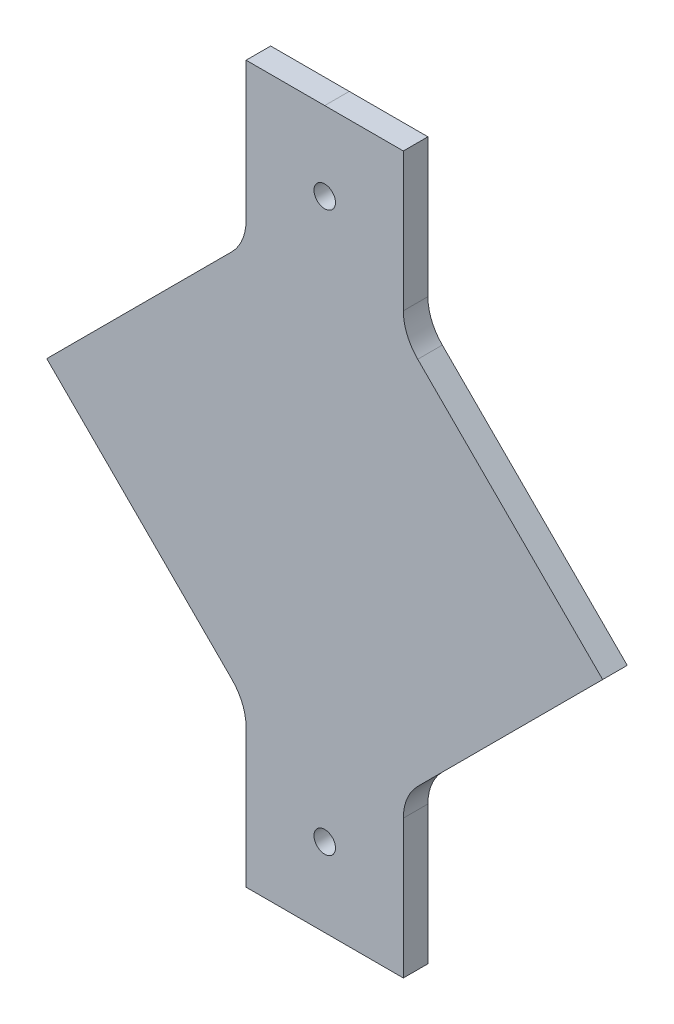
from build123d import *

# Parameters (mm, degrees)
SKETCH1_R      = 2.778125
EXTRUDE1_DEPTH = 6.35


with BuildPart() as part:
    # Sketch1 → Extrude1 (new body)
    with BuildSketch(Plane.XY):
        with BuildLine():
            Line((71.842048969, 0), (24.039743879, 47.80230509))
            ThreePointArc((24.039743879, 47.80230509), (21.286729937, 51.92248162), (20.32, 56.782561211))
            Line((20.32, 56.782561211), (20.32, 92.56248162))
            Line((20.32, 92.56248162), (-20.32, 92.56248162))
            Line((-20.32, 92.56248162), (-20.32, 56.782561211))
            ThreePointArc((-20.32, 56.782561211), (-21.286729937, 51.92248162), (-24.039743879, 47.80230509))
            Line((-24.039743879, 47.80230509), (-71.842048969, 0))
            Line((-71.842048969, 0), (-24.039743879, -47.80230509))
            ThreePointArc((-24.039743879, -47.80230509), (-21.286729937, -51.92248162), (-20.32, -56.782561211))
            Line((-20.32, -56.782561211), (-20.32, -92.56248162))
            Line((-20.32, -92.56248162), (20.32, -92.56248162))
            Line((20.32, -92.56248162), (20.32, -56.782561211))
            ThreePointArc((20.32, -56.782561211), (21.286729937, -51.92248162), (24.039743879, -47.80230509))
            Line((24.039743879, -47.80230509), (71.842048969, 0))
        make_face()
        with Locations((0, 72.24248162)):
            Circle(SKETCH1_R, mode=Mode.SUBTRACT)
        with Locations((0, -72.24248162)):
            Circle(SKETCH1_R, mode=Mode.SUBTRACT)
    extrude(amount=EXTRUDE1_DEPTH)


solid = part.part
